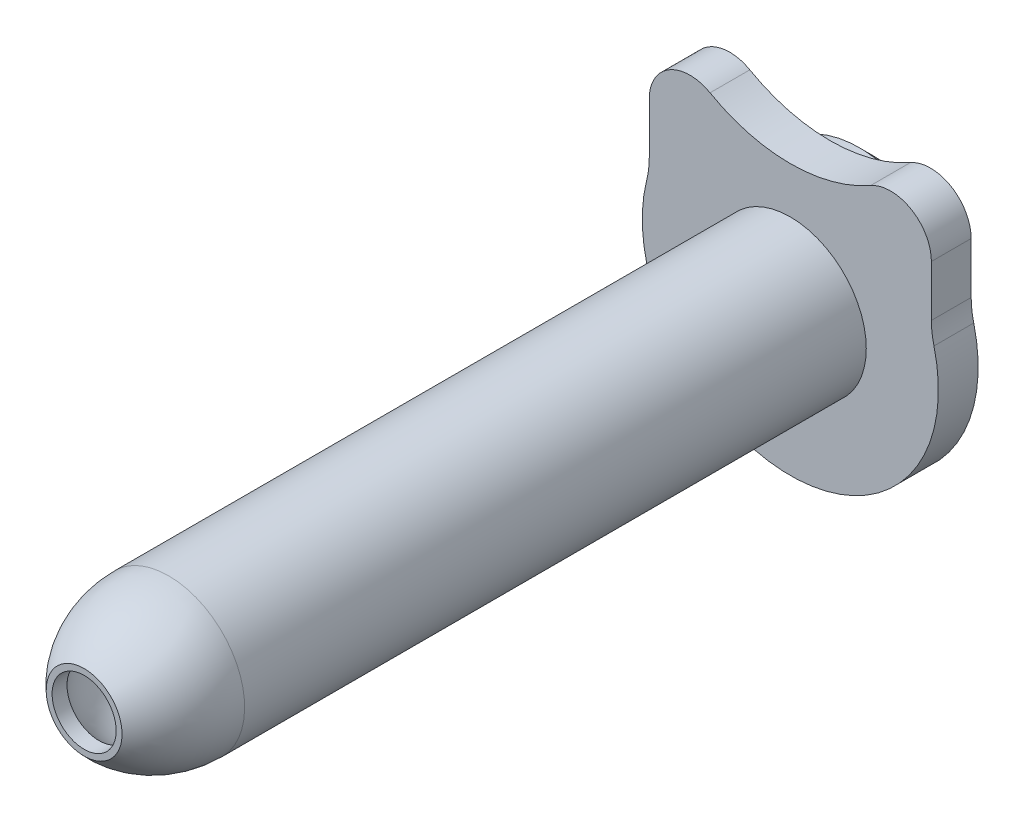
from build123d import *

# Parameters (mm, degrees)
SHELL2_T            = -0.8382
SKETCH7_R           = 1.800410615
CUT_EXTRUDE2_DEPTH  = 39.3192
BOSS_EXTRUDE1_DEPTH = 2.2352
SKETCH4_W           = 2.413
SKETCH4_H           = 1.4224
CHAMFER1_SIZE       = 0.762
CUT_EXTRUDE4_START  = -37.2872
SKETCH10_R          = 3.429
CUT_EXTRUDE4_DEPTH  = 37.2872


with BuildPart() as part:
    # Sketch2 → Revolve2 (revolve)
    with BuildSketch(Plane(origin=(0, 0, 0), x_dir=(0, 0, -1), z_dir=(1, 0, 0))):
        with BuildLine():
            Line((0, 4.2672), (-39.5732, 4.2672))
            ThreePointArc((-39.5732, 4.2672), (-42.177092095, 3.708766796), (-44.323, 2.131686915))
            Line((-44.323, 2.131686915), (-44.323, 0))
            Line((-44.323, 0), (0, 0))
            Line((0, 0), (0, 4.2672))
        make_face()
    revolve(axis=Axis((0, 0, 0), (0, 0, 1)))

    # Shell2
    shell2_openings = [part.faces().sort_by_distance(p)[0] for p in [
        (0, 0, 0),
    ]]
    offset(amount=SHELL2_T, openings=shell2_openings, kind=Kind.INTERSECTION)

    # Sketch7 → Cut-Extrude2 (cut)
    with BuildSketch(Plane(origin=(0, 0, 43.4848), x_dir=(-1, 0, 0), z_dir=(0, 0, -1))):
        with Locations(Location((0, 0, 0), (0, 0, 90))):
            Circle(SKETCH7_R)
    extrude(amount=-CUT_EXTRUDE2_DEPTH, mode=Mode.SUBTRACT)

    # Sketch3 → Boss-Extrude1 (add)
    with BuildSketch(Plane(origin=(0, 0, 4.6482), x_dir=(-1, 0, 0), z_dir=(0, 0, -1))):
        with BuildLine():
            Line((-7.9248, 3.192957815), (-7.9248, 6.05972488))
            ThreePointArc((-7.9248, 6.05972488), (-6.789394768, 8.035054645), (-4.51104, 8.048179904))
            ThreePointArc((-4.51104, 8.048179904), (0, 6.858), (4.51104, 8.048179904))
            ThreePointArc((4.51104, 8.048179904), (6.789394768, 8.035054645), (7.9248, 6.05972488))
            Line((7.9248, 6.05972488), (7.9248, 3.192957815))
            ThreePointArc((7.9248, 3.192957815), (7.961073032, 2.602372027), (8.06934686, 2.020664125))
            ThreePointArc((8.06934686, 2.020664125), (0, -8.3185), (-8.06934686, 2.020664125))
            ThreePointArc((-8.06934686, 2.020664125), (-7.961073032, 2.602372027), (-7.9248, 3.192957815))
        make_face()
    extrude(amount=BOSS_EXTRUDE1_DEPTH)

    # Sketch4 → Revolve3 (revolve)
    with BuildSketch(Plane(origin=(0, 0, 0), x_dir=(0, 0, -1), z_dir=(1, 0, 0))):
        with Locations((-1.2065, 4.9784)):
            Rectangle(SKETCH4_W, SKETCH4_H)
    revolve(axis=Axis((0, 0, 11.798529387), (0, 0, -1)))

    # Chamfer1
    chamfer1_edges = [part.edges().sort_by_distance(p)[0] for p in [
        (0, -5.6896, 0),
    ]]
    chamfer(chamfer1_edges, length=CHAMFER1_SIZE)

    # Sketch10 → Cut-Extrude4 (cut)
    with BuildSketch(Plane(origin=(0, 0, 2.413), x_dir=(-1, 0, 0), z_dir=(0, 0, -1)).offset(CUT_EXTRUDE4_START)):
        with Locations(Location((0, 0, 0), (0, 0, 90))):
            Circle(SKETCH10_R)
    extrude(amount=CUT_EXTRUDE4_DEPTH, mode=Mode.SUBTRACT)


solid = part.part
